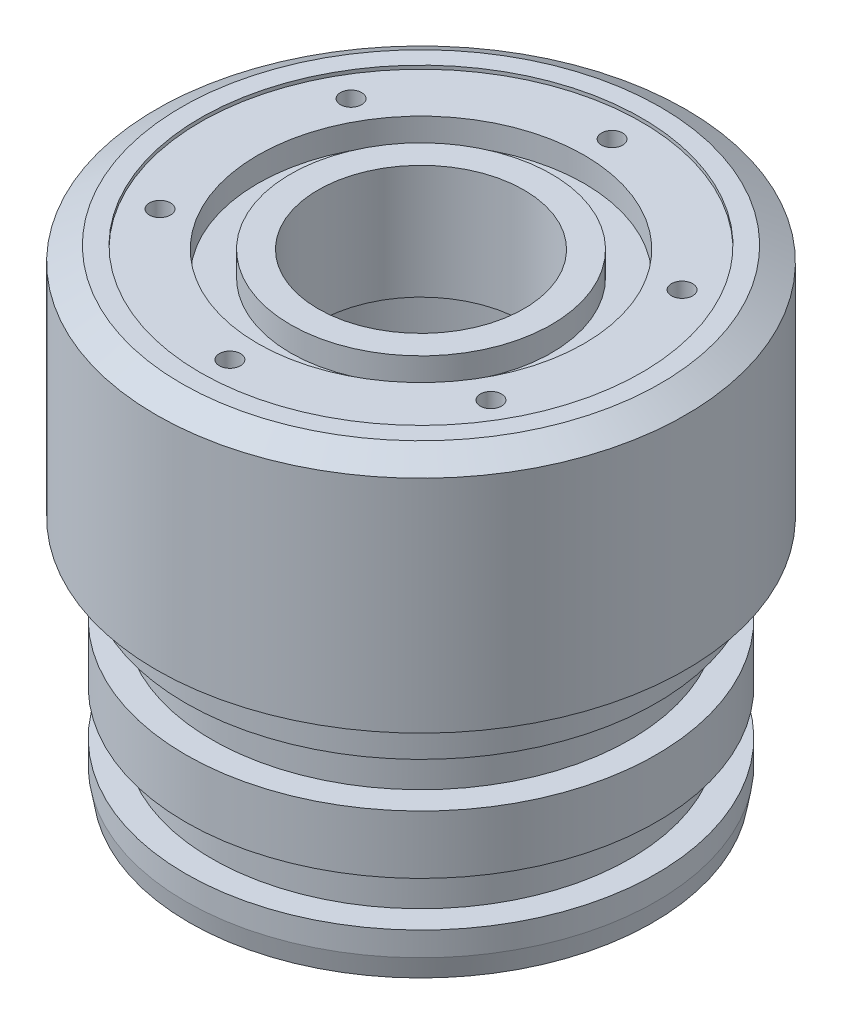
ISO-10303-21;
HEADER;
FILE_DESCRIPTION(('STEP AP214'),'2;1');
FILE_NAME('part.step','',(''),(''),'','','');
FILE_SCHEMA(('AUTOMOTIVE_DESIGN { 1 0 10303 214 1 1 1 1 }'));
ENDSEC;
DATA;
#1=APPLICATION_CONTEXT('core data for automotive mechanical design processes');
#2=APPLICATION_PROTOCOL_DEFINITION('international standard','automotive_design',2000,#1);
#3=PRODUCT_CONTEXT('',#1,'mechanical');
#4=PRODUCT('Part','Part','',(#3));
#5=PRODUCT_RELATED_PRODUCT_CATEGORY('part','',(#4));
#6=PRODUCT_DEFINITION_FORMATION('','',#4);
#7=PRODUCT_DEFINITION_CONTEXT('part definition',#1,'design');
#8=PRODUCT_DEFINITION('design','',#6,#7);
#9=PRODUCT_DEFINITION_SHAPE('','',#8);
#10=(LENGTH_UNIT() NAMED_UNIT(*) SI_UNIT(.MILLI.,.METRE.));
#11=(NAMED_UNIT(*) PLANE_ANGLE_UNIT() SI_UNIT($,.RADIAN.));
#12=(NAMED_UNIT(*) SI_UNIT($,.STERADIAN.) SOLID_ANGLE_UNIT());
#13=UNCERTAINTY_MEASURE_WITH_UNIT(LENGTH_MEASURE(1.E-05),#10,'distance_accuracy_value','');
#14=(GEOMETRIC_REPRESENTATION_CONTEXT(3) GLOBAL_UNCERTAINTY_ASSIGNED_CONTEXT((#13)) GLOBAL_UNIT_ASSIGNED_CONTEXT((#10,
#11,#12)) REPRESENTATION_CONTEXT('',''));
#15=CARTESIAN_POINT('',(0.,0.,0.));
#16=DIRECTION('',(0.,0.,1.));
#17=DIRECTION('',(1.,0.,0.));
#18=AXIS2_PLACEMENT_3D('',#15,#16,#17);
#19=CARTESIAN_POINT('',(0.,25.019,0.));
#20=DIRECTION('',(0.,1.,0.));
#21=DIRECTION('',(0.,0.,1.));
#22=AXIS2_PLACEMENT_3D('',#19,#20,#21);
#23=PLANE('',#22);
#24=CARTESIAN_POINT('',(0.,25.019,0.));
#25=DIRECTION('',(0.,1.,0.));
#26=DIRECTION('',(0.,0.,1.));
#27=AXIS2_PLACEMENT_3D('',#24,#25,#26);
#28=CIRCLE('',#27,11.1125);
#29=CARTESIAN_POINT('',(0.,25.019,11.1125));
#30=VERTEX_POINT('',#29);
#31=EDGE_CURVE('E36',#30,#30,#28,.F.);
#32=ORIENTED_EDGE('',*,*,#31,.T.);
#33=EDGE_LOOP('',(#32));
#34=FACE_BOUND('',#33,.T.);
#35=CARTESIAN_POINT('',(0.,25.019,0.));
#36=DIRECTION('',(0.,1.,0.));
#37=DIRECTION('',(0.,0.,1.));
#38=AXIS2_PLACEMENT_3D('',#35,#36,#37);
#39=CIRCLE('',#38,14.0843);
#40=CARTESIAN_POINT('',(0.,25.019,14.0843));
#41=VERTEX_POINT('',#40);
#42=EDGE_CURVE('E104',#41,#41,#39,.T.);
#43=ORIENTED_EDGE('',*,*,#42,.T.);
#44=EDGE_LOOP('',(#43));
#45=FACE_BOUND('',#44,.T.);
#46=ADVANCED_FACE('F32',(#34,#45),#23,.T.);
#47=CARTESIAN_POINT('',(0.,-25.4,0.));
#48=DIRECTION('',(0.,1.,0.));
#49=DIRECTION('',(0.,0.,1.));
#50=AXIS2_PLACEMENT_3D('',#47,#48,#49);
#51=CYLINDRICAL_SURFACE('',#50,11.1125);
#52=CARTESIAN_POINT('',(0.,12.7,0.));
#53=DIRECTION('',(0.,-1.,0.));
#54=DIRECTION('',(0.,0.,-1.));
#55=AXIS2_PLACEMENT_3D('',#52,#53,#54);
#56=CIRCLE('',#55,11.1125);
#57=CARTESIAN_POINT('',(0.,12.7,-11.1125));
#58=VERTEX_POINT('',#57);
#59=EDGE_CURVE('E86',#58,#58,#56,.T.);
#60=ORIENTED_EDGE('',*,*,#59,.T.);
#61=EDGE_LOOP('',(#60));
#62=FACE_BOUND('',#61,.T.);
#63=ORIENTED_EDGE('',*,*,#31,.F.);
#64=EDGE_LOOP('',(#63));
#65=FACE_BOUND('',#64,.T.);
#66=ADVANCED_FACE('F192',(#62,#65),#51,.F.);
#67=CARTESIAN_POINT('',(0.,-25.4,0.));
#68=DIRECTION('',(0.,1.,0.));
#69=DIRECTION('',(0.,0.,1.));
#70=AXIS2_PLACEMENT_3D('',#67,#68,#69);
#71=CYLINDRICAL_SURFACE('',#70,25.4);
#72=CARTESIAN_POINT('',(0.,-9.525,0.));
#73=DIRECTION('',(0.,-1.,0.));
#74=DIRECTION('',(0.,0.,-1.));
#75=AXIS2_PLACEMENT_3D('',#72,#73,#74);
#76=CIRCLE('',#75,25.4);
#77=CARTESIAN_POINT('',(0.,-9.525,-25.4));
#78=VERTEX_POINT('',#77);
#79=EDGE_CURVE('E57',#78,#78,#76,.F.);
#80=ORIENTED_EDGE('',*,*,#79,.F.);
#81=EDGE_LOOP('',(#80));
#82=FACE_BOUND('',#81,.T.);
#83=CARTESIAN_POINT('',(0.,-15.8242,0.));
#84=DIRECTION('',(0.,-1.,0.));
#85=DIRECTION('',(0.,0.,-1.));
#86=AXIS2_PLACEMENT_3D('',#83,#84,#85);
#87=CIRCLE('',#86,25.4);
#88=CARTESIAN_POINT('',(0.,-15.8242,-25.4));
#89=VERTEX_POINT('',#88);
#90=EDGE_CURVE('E61',#89,#89,#87,.F.);
#91=ORIENTED_EDGE('',*,*,#90,.T.);
#92=EDGE_LOOP('',(#91));
#93=FACE_BOUND('',#92,.T.);
#94=ADVANCED_FACE('F197',(#82,#93),#71,.T.);
#95=CARTESIAN_POINT('',(0.,-15.8242,0.));
#96=DIRECTION('',(0.,-1.,0.));
#97=DIRECTION('',(0.,0.,-1.));
#98=AXIS2_PLACEMENT_3D('',#95,#96,#97);
#99=PLANE('',#98);
#100=ORIENTED_EDGE('',*,*,#90,.F.);
#101=EDGE_LOOP('',(#100));
#102=FACE_BOUND('',#101,.T.);
#103=CARTESIAN_POINT('',(0.,-15.8242,0.));
#104=DIRECTION('',(0.,-1.,0.));
#105=DIRECTION('',(0.,0.,-1.));
#106=AXIS2_PLACEMENT_3D('',#103,#104,#105);
#107=CIRCLE('',#106,22.5806);
#108=CARTESIAN_POINT('',(0.,-15.8242,-22.5806));
#109=VERTEX_POINT('',#108);
#110=EDGE_CURVE('E68',#109,#109,#107,.T.);
#111=ORIENTED_EDGE('',*,*,#110,.F.);
#112=EDGE_LOOP('',(#111));
#113=FACE_BOUND('',#112,.T.);
#114=ADVANCED_FACE('F223',(#102,#113),#99,.T.);
#115=CARTESIAN_POINT('',(0.,-20.6502,0.));
#116=DIRECTION('',(0.,-1.,0.));
#117=DIRECTION('',(0.,0.,-1.));
#118=AXIS2_PLACEMENT_3D('',#115,#116,#117);
#119=PLANE('',#118);
#120=CARTESIAN_POINT('',(0.,-20.6502,0.));
#121=DIRECTION('',(0.,-1.,0.));
#122=DIRECTION('',(0.,0.,-1.));
#123=AXIS2_PLACEMENT_3D('',#120,#121,#122);
#124=CIRCLE('',#123,25.4);
#125=CARTESIAN_POINT('',(0.,-20.6502,-25.4));
#126=VERTEX_POINT('',#125);
#127=EDGE_CURVE('E65',#126,#126,#124,.F.);
#128=ORIENTED_EDGE('',*,*,#127,.T.);
#129=EDGE_LOOP('',(#128));
#130=FACE_BOUND('',#129,.T.);
#131=CARTESIAN_POINT('',(0.,-20.6502,0.));
#132=DIRECTION('',(0.,-1.,0.));
#133=DIRECTION('',(0.,0.,-1.));
#134=AXIS2_PLACEMENT_3D('',#131,#132,#133);
#135=CIRCLE('',#134,22.5806);
#136=CARTESIAN_POINT('',(0.,-20.6502,-22.5806));
#137=VERTEX_POINT('',#136);
#138=EDGE_CURVE('E56',#137,#137,#135,.T.);
#139=ORIENTED_EDGE('',*,*,#138,.T.);
#140=EDGE_LOOP('',(#139));
#141=FACE_BOUND('',#140,.T.);
#142=ADVANCED_FACE('F221',(#130,#141),#119,.F.);
#143=CARTESIAN_POINT('',(0.,-15.8242,0.));
#144=DIRECTION('',(0.,-1.,0.));
#145=DIRECTION('',(0.,0.,-1.));
#146=AXIS2_PLACEMENT_3D('',#143,#144,#145);
#147=CYLINDRICAL_SURFACE('',#146,22.5806);
#148=ORIENTED_EDGE('',*,*,#110,.T.);
#149=EDGE_LOOP('',(#148));
#150=FACE_BOUND('',#149,.T.);
#151=ORIENTED_EDGE('',*,*,#138,.F.);
#152=EDGE_LOOP('',(#151));
#153=FACE_BOUND('',#152,.T.);
#154=ADVANCED_FACE('F217',(#150,#153),#147,.T.);
#155=CARTESIAN_POINT('',(0.,12.7,0.));
#156=DIRECTION('',(0.,-1.,0.));
#157=DIRECTION('',(0.,0.,-1.));
#158=AXIS2_PLACEMENT_3D('',#155,#156,#157);
#159=PLANE('',#158);
#160=ORIENTED_EDGE('',*,*,#59,.F.);
#161=EDGE_LOOP('',(#160));
#162=FACE_BOUND('',#161,.T.);
#163=CARTESIAN_POINT('',(0.,12.7,0.));
#164=DIRECTION('',(0.,-1.,0.));
#165=DIRECTION('',(0.,0.,-1.));
#166=AXIS2_PLACEMENT_3D('',#163,#164,#165);
#167=CIRCLE('',#166,19.05);
#168=CARTESIAN_POINT('',(0.,12.7,-19.05));
#169=VERTEX_POINT('',#168);
#170=EDGE_CURVE('E74',#169,#169,#167,.T.);
#171=ORIENTED_EDGE('',*,*,#170,.T.);
#172=EDGE_LOOP('',(#171));
#173=FACE_BOUND('',#172,.T.);
#174=ADVANCED_FACE('F220',(#162,#173),#159,.T.);
#175=CARTESIAN_POINT('',(0.,12.7,0.));
#176=DIRECTION('',(0.,-1.,0.));
#177=DIRECTION('',(0.,0.,-1.));
#178=AXIS2_PLACEMENT_3D('',#175,#176,#177);
#179=CYLINDRICAL_SURFACE('',#178,19.05);
#180=CARTESIAN_POINT('',(0.,-25.4,0.));
#181=DIRECTION('',(0.,-1.,0.));
#182=DIRECTION('',(0.,0.,-1.));
#183=AXIS2_PLACEMENT_3D('',#180,#181,#182);
#184=CIRCLE('',#183,19.05);
#185=CARTESIAN_POINT('',(0.,-25.4,-19.05));
#186=VERTEX_POINT('',#185);
#187=EDGE_CURVE('E64',#186,#186,#184,.T.);
#188=CARTESIAN_POINT('',(0.,12.7,-19.05));
#189=CARTESIAN_POINT('',(0.,12.303125,-19.05));
#190=CARTESIAN_POINT('',(0.,11.90625,-19.05));
#191=CARTESIAN_POINT('',(0.,11.1125,-19.05));
#192=CARTESIAN_POINT('',(0.,10.715625,-19.05));
#193=CARTESIAN_POINT('',(0.,9.921875,-19.05));
#194=CARTESIAN_POINT('',(0.,9.525,-19.05));
#195=CARTESIAN_POINT('',(0.,8.73125,-19.05));
#196=CARTESIAN_POINT('',(0.,8.334375,-19.05));
#197=CARTESIAN_POINT('',(0.,7.540625,-19.05));
#198=CARTESIAN_POINT('',(0.,7.14375,-19.05));
#199=CARTESIAN_POINT('',(0.,6.35,-19.05));
#200=CARTESIAN_POINT('',(0.,5.953125,-19.05));
#201=CARTESIAN_POINT('',(0.,5.159375,-19.05));
#202=CARTESIAN_POINT('',(0.,4.7625,-19.05));
#203=CARTESIAN_POINT('',(0.,3.96875,-19.05));
#204=CARTESIAN_POINT('',(0.,3.571875,-19.05));
#205=CARTESIAN_POINT('',(0.,2.778125,-19.05));
#206=CARTESIAN_POINT('',(0.,2.38125,-19.05));
#207=CARTESIAN_POINT('',(0.,1.5875,-19.05));
#208=CARTESIAN_POINT('',(0.,1.190625,-19.05));
#209=CARTESIAN_POINT('',(0.,0.396875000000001,-19.05));
#210=CARTESIAN_POINT('',(0.,0.,-19.05));
#211=CARTESIAN_POINT('',(0.,-0.793749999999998,-19.05));
#212=CARTESIAN_POINT('',(0.,-1.190625,-19.05));
#213=CARTESIAN_POINT('',(0.,-1.984375,-19.05));
#214=CARTESIAN_POINT('',(0.,-2.38125,-19.05));
#215=CARTESIAN_POINT('',(0.,-3.175,-19.05));
#216=CARTESIAN_POINT('',(0.,-3.571875,-19.05));
#217=CARTESIAN_POINT('',(0.,-4.365625,-19.05));
#218=CARTESIAN_POINT('',(0.,-4.7625,-19.05));
#219=CARTESIAN_POINT('',(0.,-5.55625,-19.05));
#220=CARTESIAN_POINT('',(0.,-5.953125,-19.05));
#221=CARTESIAN_POINT('',(0.,-6.746875,-19.05));
#222=CARTESIAN_POINT('',(0.,-7.14375,-19.05));
#223=CARTESIAN_POINT('',(0.,-7.9375,-19.05));
#224=CARTESIAN_POINT('',(0.,-8.334375,-19.05));
#225=CARTESIAN_POINT('',(0.,-9.128125,-19.05));
#226=CARTESIAN_POINT('',(0.,-9.525,-19.05));
#227=CARTESIAN_POINT('',(0.,-10.31875,-19.05));
#228=CARTESIAN_POINT('',(0.,-10.715625,-19.05));
#229=CARTESIAN_POINT('',(0.,-11.509375,-19.05));
#230=CARTESIAN_POINT('',(0.,-11.90625,-19.05));
#231=CARTESIAN_POINT('',(0.,-12.7,-19.05));
#232=CARTESIAN_POINT('',(0.,-13.096875,-19.05));
#233=CARTESIAN_POINT('',(0.,-13.890625,-19.05));
#234=CARTESIAN_POINT('',(0.,-14.2875,-19.05));
#235=CARTESIAN_POINT('',(0.,-15.08125,-19.05));
#236=CARTESIAN_POINT('',(0.,-15.478125,-19.05));
#237=CARTESIAN_POINT('',(0.,-16.271875,-19.05));
#238=CARTESIAN_POINT('',(0.,-16.66875,-19.05));
#239=CARTESIAN_POINT('',(0.,-17.4625,-19.05));
#240=CARTESIAN_POINT('',(0.,-17.859375,-19.05));
#241=CARTESIAN_POINT('',(0.,-18.653125,-19.05));
#242=CARTESIAN_POINT('',(0.,-19.05,-19.05));
#243=CARTESIAN_POINT('',(0.,-19.84375,-19.05));
#244=CARTESIAN_POINT('',(0.,-20.240625,-19.05));
#245=CARTESIAN_POINT('',(0.,-21.034375,-19.05));
#246=CARTESIAN_POINT('',(0.,-21.43125,-19.05));
#247=CARTESIAN_POINT('',(0.,-22.225,-19.05));
#248=CARTESIAN_POINT('',(0.,-22.621875,-19.05));
#249=CARTESIAN_POINT('',(0.,-23.415625,-19.05));
#250=CARTESIAN_POINT('',(0.,-23.8125,-19.05));
#251=CARTESIAN_POINT('',(0.,-24.60625,-19.05));
#252=CARTESIAN_POINT('',(0.,-25.003125,-19.05));
#253=CARTESIAN_POINT('',(0.,-25.4,-19.05));
#254=B_SPLINE_CURVE_WITH_KNOTS('',3,(#188,#189,#190,#191,#192,#193,#194,#195,#196,#197,#198,
#199,#200,#201,#202,#203,#204,#205,#206,#207,#208,#209,#210,#211,#212,#213,#214,#215,#216,#217,
#218,#219,#220,#221,#222,#223,#224,#225,#226,#227,#228,#229,#230,#231,#232,#233,#234,#235,#236,
#237,#238,#239,#240,#241,#242,#243,#244,#245,#246,#247,#248,#249,#250,#251,#252,#253),
.UNSPECIFIED.,.F.,.F.,(4,2,2,2,2,2,2,2,2,2,2,2,2,2,2,2,2,2,2,2,2,2,2,2,2,2,2,2,2,2,2,2,4),(0.,
1.190625,2.38125,3.571875,4.7625,5.953125,7.14375,8.334375,9.525,10.715625,11.90625,13.096875,
14.2875,15.478125,16.66875,17.859375,19.05,20.240625,21.43125,22.621875,23.8125,25.003125,
26.19375,27.384375,28.575,29.765625,30.95625,32.146875,33.3375,34.528125,35.71875,36.909375,
38.1),.UNSPECIFIED.);
#255=EDGE_CURVE('BSEAM232',#169,#186,#254,.T.);
#256=ORIENTED_EDGE('',*,*,#170,.F.);
#257=ORIENTED_EDGE('',*,*,#187,.T.);
#258=ORIENTED_EDGE('',*,*,#255,.T.);
#259=ORIENTED_EDGE('',*,*,#255,.F.);
#260=EDGE_LOOP('',(#256,#258,#257,#259));
#261=FACE_BOUND('',#260,.T.);
#262=ADVANCED_FACE('F232',(#261),#179,.F.);
#263=CARTESIAN_POINT('',(0.,-25.4,0.));
#264=DIRECTION('',(0.,1.,0.));
#265=DIRECTION('',(0.,0.,1.));
#266=AXIS2_PLACEMENT_3D('',#263,#264,#265);
#267=PLANE('',#266);
#268=CARTESIAN_POINT('',(0.,-25.4,0.));
#269=DIRECTION('',(0.,1.,0.));
#270=DIRECTION('',(0.,0.,1.));
#271=AXIS2_PLACEMENT_3D('',#268,#269,#270);
#272=CIRCLE('',#271,25.019);
#273=CARTESIAN_POINT('',(0.,-25.4,25.019));
#274=VERTEX_POINT('',#273);
#275=EDGE_CURVE('E44',#274,#274,#272,.F.);
#276=ORIENTED_EDGE('',*,*,#275,.T.);
#277=EDGE_LOOP('',(#276));
#278=FACE_BOUND('',#277,.T.);
#279=ORIENTED_EDGE('',*,*,#187,.F.);
#280=EDGE_LOOP('',(#279));
#281=FACE_BOUND('',#280,.T.);
#282=ADVANCED_FACE('F235',(#278,#281),#267,.F.);
#283=CARTESIAN_POINT('',(0.,-23.2392416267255,0.));
#284=DIRECTION('',(0.,1.,0.));
#285=DIRECTION('',(0.,0.,1.));
#286=AXIS2_PLACEMENT_3D('',#283,#284,#285);
#287=CIRCLE('',#286,25.4);
#288=CARTESIAN_POINT('',(0.,-23.2392416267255,25.4));
#289=VERTEX_POINT('',#288);
#290=EDGE_CURVE('E49',#289,#289,#287,.T.);
#291=ORIENTED_EDGE('',*,*,#290,.T.);
#292=EDGE_LOOP('',(#291));
#293=FACE_BOUND('',#292,.T.);
#294=ORIENTED_EDGE('',*,*,#127,.F.);
#295=EDGE_LOOP('',(#294));
#296=FACE_BOUND('',#295,.T.);
#297=ADVANCED_FACE('F212',(#293,#296),#71,.T.);
#298=CARTESIAN_POINT('',(0.,-4.699,0.));
#299=DIRECTION('',(0.,-1.,0.));
#300=DIRECTION('',(0.,0.,-1.));
#301=AXIS2_PLACEMENT_3D('',#298,#299,#300);
#302=PLANE('',#301);
#303=CARTESIAN_POINT('',(0.,-4.699,0.));
#304=DIRECTION('',(0.,-1.,0.));
#305=DIRECTION('',(0.,0.,-1.));
#306=AXIS2_PLACEMENT_3D('',#303,#304,#305);
#307=CIRCLE('',#306,25.4);
#308=CARTESIAN_POINT('',(0.,-4.699,-25.4));
#309=VERTEX_POINT('',#308);
#310=EDGE_CURVE('E53',#309,#309,#307,.F.);
#311=ORIENTED_EDGE('',*,*,#310,.F.);
#312=EDGE_LOOP('',(#311));
#313=FACE_BOUND('',#312,.T.);
#314=CARTESIAN_POINT('',(0.,-4.699,0.));
#315=DIRECTION('',(0.,-1.,0.));
#316=DIRECTION('',(0.,0.,-1.));
#317=AXIS2_PLACEMENT_3D('',#314,#315,#316);
#318=CIRCLE('',#317,22.5806);
#319=CARTESIAN_POINT('',(0.,-4.699,-22.5806));
#320=VERTEX_POINT('',#319);
#321=EDGE_CURVE('E60',#320,#320,#318,.T.);
#322=ORIENTED_EDGE('',*,*,#321,.F.);
#323=EDGE_LOOP('',(#322));
#324=FACE_BOUND('',#323,.T.);
#325=ADVANCED_FACE('F209',(#313,#324),#302,.T.);
#326=CARTESIAN_POINT('',(0.,-9.525,0.));
#327=DIRECTION('',(0.,-1.,0.));
#328=DIRECTION('',(0.,0.,-1.));
#329=AXIS2_PLACEMENT_3D('',#326,#327,#328);
#330=PLANE('',#329);
#331=ORIENTED_EDGE('',*,*,#79,.T.);
#332=EDGE_LOOP('',(#331));
#333=FACE_BOUND('',#332,.T.);
#334=CARTESIAN_POINT('',(0.,-9.525,0.));
#335=DIRECTION('',(0.,-1.,0.));
#336=DIRECTION('',(0.,0.,-1.));
#337=AXIS2_PLACEMENT_3D('',#334,#335,#336);
#338=CIRCLE('',#337,22.5806);
#339=CARTESIAN_POINT('',(0.,-9.525,-22.5806));
#340=VERTEX_POINT('',#339);
#341=EDGE_CURVE('E83',#340,#340,#338,.T.);
#342=ORIENTED_EDGE('',*,*,#341,.T.);
#343=EDGE_LOOP('',(#342));
#344=FACE_BOUND('',#343,.T.);
#345=ADVANCED_FACE('F207',(#333,#344),#330,.F.);
#346=CARTESIAN_POINT('',(0.,-4.699,0.));
#347=DIRECTION('',(0.,-1.,0.));
#348=DIRECTION('',(0.,0.,-1.));
#349=AXIS2_PLACEMENT_3D('',#346,#347,#348);
#350=CYLINDRICAL_SURFACE('',#349,22.5806);
#351=ORIENTED_EDGE('',*,*,#321,.T.);
#352=EDGE_LOOP('',(#351));
#353=FACE_BOUND('',#352,.T.);
#354=ORIENTED_EDGE('',*,*,#341,.F.);
#355=EDGE_LOOP('',(#354));
#356=FACE_BOUND('',#355,.T.);
#357=ADVANCED_FACE('F179',(#353,#356),#350,.T.);
#358=CARTESIAN_POINT('',(0.,25.4,0.));
#359=DIRECTION('',(0.,1.,0.));
#360=DIRECTION('',(0.,0.,1.));
#361=AXIS2_PLACEMENT_3D('',#358,#359,#360);
#362=PLANE('',#361);
#363=CARTESIAN_POINT('',(0.,25.4,0.));
#364=DIRECTION('',(0.,1.,0.));
#365=DIRECTION('',(0.,0.,1.));
#366=AXIS2_PLACEMENT_3D('',#363,#364,#365);
#367=CIRCLE('',#366,23.8125);
#368=CARTESIAN_POINT('',(0.,25.4,23.8125));
#369=VERTEX_POINT('',#368);
#370=EDGE_CURVE('E91',#369,#369,#367,.T.);
#371=ORIENTED_EDGE('',*,*,#370,.F.);
#372=EDGE_LOOP('',(#371));
#373=FACE_BOUND('',#372,.T.);
#374=CARTESIAN_POINT('',(0.,25.4,0.));
#375=DIRECTION('',(0.,1.,0.));
#376=DIRECTION('',(0.,0.,1.));
#377=AXIS2_PLACEMENT_3D('',#374,#375,#376);
#378=CIRCLE('',#377,25.8473663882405);
#379=CARTESIAN_POINT('',(0.,25.4,25.8473663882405));
#380=VERTEX_POINT('',#379);
#381=EDGE_CURVE('E40',#380,#380,#378,.T.);
#382=ORIENTED_EDGE('',*,*,#381,.T.);
#383=EDGE_LOOP('',(#382));
#384=FACE_BOUND('',#383,.T.);
#385=ADVANCED_FACE('F175',(#373,#384),#362,.T.);
#386=CARTESIAN_POINT('',(0.,25.4,0.));
#387=DIRECTION('',(0.,-1.,0.));
#388=DIRECTION('',(0.,0.,-1.));
#389=AXIS2_PLACEMENT_3D('',#386,#387,#388);
#390=CYLINDRICAL_SURFACE('',#389,28.575);
#391=CARTESIAN_POINT('',(0.,23.8252,0.));
#392=DIRECTION('',(0.,1.,0.));
#393=DIRECTION('',(0.,0.,1.));
#394=AXIS2_PLACEMENT_3D('',#391,#392,#393);
#395=CIRCLE('',#394,28.575);
#396=CARTESIAN_POINT('',(0.,23.8252,28.575));
#397=VERTEX_POINT('',#396);
#398=EDGE_CURVE('E11',#397,#397,#395,.F.);
#399=ORIENTED_EDGE('',*,*,#398,.T.);
#400=EDGE_LOOP('',(#399));
#401=FACE_BOUND('',#400,.T.);
#402=CARTESIAN_POINT('',(0.,0.,0.));
#403=DIRECTION('',(0.,1.,0.));
#404=DIRECTION('',(0.,0.,1.));
#405=AXIS2_PLACEMENT_3D('',#402,#403,#404);
#406=CIRCLE('',#405,28.575);
#407=CARTESIAN_POINT('',(0.,0.,28.575));
#408=VERTEX_POINT('',#407);
#409=EDGE_CURVE('E71',#408,#408,#406,.T.);
#410=ORIENTED_EDGE('',*,*,#409,.T.);
#411=EDGE_LOOP('',(#410));
#412=FACE_BOUND('',#411,.T.);
#413=ADVANCED_FACE('F178',(#401,#412),#390,.T.);
#414=CARTESIAN_POINT('',(0.,0.,0.));
#415=DIRECTION('',(0.,1.,0.));
#416=DIRECTION('',(0.,0.,1.));
#417=AXIS2_PLACEMENT_3D('',#414,#415,#416);
#418=PLANE('',#417);
#419=CARTESIAN_POINT('',(0.,0.,0.));
#420=DIRECTION('',(0.,1.,0.));
#421=DIRECTION('',(0.,0.,1.));
#422=AXIS2_PLACEMENT_3D('',#419,#420,#421);
#423=CIRCLE('',#422,25.4);
#424=CARTESIAN_POINT('',(0.,0.,25.4));
#425=VERTEX_POINT('',#424);
#426=EDGE_CURVE('E52',#425,#425,#423,.T.);
#427=ORIENTED_EDGE('',*,*,#426,.T.);
#428=EDGE_LOOP('',(#427));
#429=FACE_BOUND('',#428,.T.);
#430=ORIENTED_EDGE('',*,*,#409,.F.);
#431=EDGE_LOOP('',(#430));
#432=FACE_BOUND('',#431,.T.);
#433=ADVANCED_FACE('F238',(#429,#432),#418,.F.);
#434=ORIENTED_EDGE('',*,*,#426,.F.);
#435=EDGE_LOOP('',(#434));
#436=FACE_BOUND('',#435,.T.);
#437=ORIENTED_EDGE('',*,*,#310,.T.);
#438=EDGE_LOOP('',(#437));
#439=FACE_BOUND('',#438,.T.);
#440=ADVANCED_FACE('F189',(#436,#439),#71,.T.);
#441=CARTESIAN_POINT('',(0.,-23.2392416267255,0.));
#442=DIRECTION('',(0.,1.,0.));
#443=DIRECTION('',(0.,0.,1.));
#444=AXIS2_PLACEMENT_3D('',#441,#442,#443);
#445=CONICAL_SURFACE('',#444,25.4,0.174532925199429);
#446=CARTESIAN_POINT('',(0.,-25.4,25.019));
#447=CARTESIAN_POINT('',(0.,-25.3774921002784,25.02296875));
#448=CARTESIAN_POINT('',(0.,-25.3549842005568,25.0269375));
#449=CARTESIAN_POINT('',(0.,-25.3099684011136,25.034875));
#450=CARTESIAN_POINT('',(0.,-25.287460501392,25.03884375));
#451=CARTESIAN_POINT('',(0.,-25.2424447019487,25.04678125));
#452=CARTESIAN_POINT('',(0.,-25.2199368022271,25.05075));
#453=CARTESIAN_POINT('',(0.,-25.1749210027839,25.0586875));
#454=CARTESIAN_POINT('',(0.,-25.1524131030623,25.06265625));
#455=CARTESIAN_POINT('',(0.,-25.1073973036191,25.07059375));
#456=CARTESIAN_POINT('',(0.,-25.0848894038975,25.0745625));
#457=CARTESIAN_POINT('',(0.,-25.0398736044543,25.0825));
#458=CARTESIAN_POINT('',(0.,-25.0173657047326,25.08646875));
#459=CARTESIAN_POINT('',(0.,-24.9723499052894,25.09440625));
#460=CARTESIAN_POINT('',(0.,-24.9498420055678,25.098375));
#461=CARTESIAN_POINT('',(0.,-24.9048262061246,25.1063125));
#462=CARTESIAN_POINT('',(0.,-24.882318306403,25.11028125));
#463=CARTESIAN_POINT('',(0.,-24.8373025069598,25.11821875));
#464=CARTESIAN_POINT('',(0.,-24.8147946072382,25.1221875));
#465=CARTESIAN_POINT('',(0.,-24.7697788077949,25.130125));
#466=CARTESIAN_POINT('',(0.,-24.7472709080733,25.13409375));
#467=CARTESIAN_POINT('',(0.,-24.7022551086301,25.14203125));
#468=CARTESIAN_POINT('',(0.,-24.6797472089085,25.146));
#469=CARTESIAN_POINT('',(0.,-24.6347314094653,25.1539375));
#470=CARTESIAN_POINT('',(0.,-24.6122235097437,25.15790625));
#471=CARTESIAN_POINT('',(0.,-24.5672077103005,25.16584375));
#472=CARTESIAN_POINT('',(0.,-24.5446998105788,25.1698125));
#473=CARTESIAN_POINT('',(0.,-24.4996840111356,25.17775));
#474=CARTESIAN_POINT('',(0.,-24.477176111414,25.18171875));
#475=CARTESIAN_POINT('',(0.,-24.4321603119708,25.18965625));
#476=CARTESIAN_POINT('',(0.,-24.4096524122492,25.193625));
#477=CARTESIAN_POINT('',(0.,-24.364636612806,25.2015625));
#478=CARTESIAN_POINT('',(0.,-24.3421287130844,25.20553125));
#479=CARTESIAN_POINT('',(0.,-24.2971129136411,25.21346875));
#480=CARTESIAN_POINT('',(0.,-24.2746050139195,25.2174375));
#481=CARTESIAN_POINT('',(0.,-24.2295892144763,25.225375));
#482=CARTESIAN_POINT('',(0.,-24.2070813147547,25.22934375));
#483=CARTESIAN_POINT('',(0.,-24.1620655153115,25.23728125));
#484=CARTESIAN_POINT('',(0.,-24.1395576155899,25.24125));
#485=CARTESIAN_POINT('',(0.,-24.0945418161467,25.2491875));
#486=CARTESIAN_POINT('',(0.,-24.072033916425,25.25315625));
#487=CARTESIAN_POINT('',(0.,-24.0270181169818,25.26109375));
#488=CARTESIAN_POINT('',(0.,-24.0045102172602,25.2650625));
#489=CARTESIAN_POINT('',(0.,-23.959494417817,25.273));
#490=CARTESIAN_POINT('',(0.,-23.9369865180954,25.27696875));
#491=CARTESIAN_POINT('',(0.,-23.8919707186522,25.28490625));
#492=CARTESIAN_POINT('',(0.,-23.8694628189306,25.288875));
#493=CARTESIAN_POINT('',(0.,-23.8244470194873,25.2968125));
#494=CARTESIAN_POINT('',(0.,-23.8019391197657,25.30078125));
#495=CARTESIAN_POINT('',(0.,-23.7569233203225,25.30871875));
#496=CARTESIAN_POINT('',(0.,-23.7344154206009,25.3126875));
#497=CARTESIAN_POINT('',(0.,-23.6893996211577,25.320625));
#498=CARTESIAN_POINT('',(0.,-23.6668917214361,25.32459375));
#499=CARTESIAN_POINT('',(0.,-23.6218759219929,25.33253125));
#500=CARTESIAN_POINT('',(0.,-23.5993680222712,25.3365));
#501=CARTESIAN_POINT('',(0.,-23.554352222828,25.3444375));
#502=CARTESIAN_POINT('',(0.,-23.5318443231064,25.34840625));
#503=CARTESIAN_POINT('',(0.,-23.4868285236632,25.35634375));
#504=CARTESIAN_POINT('',(0.,-23.4643206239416,25.3603125));
#505=CARTESIAN_POINT('',(0.,-23.4193048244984,25.36825));
#506=CARTESIAN_POINT('',(0.,-23.3967969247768,25.37221875));
#507=CARTESIAN_POINT('',(0.,-23.3517811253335,25.38015625));
#508=CARTESIAN_POINT('',(0.,-23.3292732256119,25.384125));
#509=CARTESIAN_POINT('',(0.,-23.2842574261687,25.3920625));
#510=CARTESIAN_POINT('',(0.,-23.2617495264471,25.39603125));
#511=CARTESIAN_POINT('',(0.,-23.2392416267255,25.4));
#512=B_SPLINE_CURVE_WITH_KNOTS('',3,(#446,#447,#448,#449,#450,#451,#452,#453,#454,#455,#456,
#457,#458,#459,#460,#461,#462,#463,#464,#465,#466,#467,#468,#469,#470,#471,#472,#473,#474,#475,
#476,#477,#478,#479,#480,#481,#482,#483,#484,#485,#486,#487,#488,#489,#490,#491,#492,#493,#494,
#495,#496,#497,#498,#499,#500,#501,#502,#503,#504,#505,#506,#507,#508,#509,#510,#511),
.UNSPECIFIED.,.F.,.F.,(4,2,2,2,2,2,2,2,2,2,2,2,2,2,2,2,2,2,2,2,2,2,2,2,2,2,2,2,2,2,2,2,4),(0.,
0.0685653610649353,0.137130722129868,0.205696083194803,0.274261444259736,0.342826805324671,
0.411392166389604,0.479957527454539,0.548522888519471,0.617088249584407,0.685653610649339,
0.754218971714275,0.822784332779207,0.891349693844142,0.959915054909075,1.02848041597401,
1.09704577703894,1.16561113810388,1.23417649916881,1.30274186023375,1.37130722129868,
1.43987258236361,1.50843794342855,1.57700330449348,1.64556866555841,1.71413402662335,
1.78269938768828,1.85126474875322,1.91983010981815,1.98839547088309,2.05696083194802,
2.12552619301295,2.19409155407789),.UNSPECIFIED.);
#513=EDGE_CURVE('BSEAM184',#274,#289,#512,.T.);
#514=ORIENTED_EDGE('',*,*,#275,.F.);
#515=ORIENTED_EDGE('',*,*,#290,.F.);
#516=ORIENTED_EDGE('',*,*,#513,.T.);
#517=ORIENTED_EDGE('',*,*,#513,.F.);
#518=EDGE_LOOP('',(#514,#516,#515,#517));
#519=FACE_BOUND('',#518,.T.);
#520=ADVANCED_FACE('F184',(#519),#445,.T.);
#521=CARTESIAN_POINT('',(0.,25.4,0.));
#522=DIRECTION('',(0.,-1.,0.));
#523=DIRECTION('',(0.,0.,-1.));
#524=AXIS2_PLACEMENT_3D('',#521,#522,#523);
#525=CONICAL_SURFACE('',#524,25.8473663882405,1.04719755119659);
#526=ORIENTED_EDGE('',*,*,#398,.F.);
#527=EDGE_LOOP('',(#526));
#528=FACE_BOUND('',#527,.T.);
#529=ORIENTED_EDGE('',*,*,#381,.F.);
#530=EDGE_LOOP('',(#529));
#531=FACE_BOUND('',#530,.T.);
#532=ADVANCED_FACE('F34',(#528,#531),#525,.T.);
#533=CARTESIAN_POINT('',(17.8616007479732,25.019,-10.3124000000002));
#534=DIRECTION('',(0.,1.,0.));
#535=DIRECTION('',(-0.866025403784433,0.,0.50000000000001));
#536=AXIS2_PLACEMENT_3D('',#533,#534,#535);
#537=CIRCLE('',#536,1.143);
#538=CARTESIAN_POINT('',(16.8717337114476,25.019,-9.7409000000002));
#539=VERTEX_POINT('',#538);
#540=EDGE_CURVE('E122',#539,#539,#537,.T.);
#541=ORIENTED_EDGE('',*,*,#540,.F.);
#542=EDGE_LOOP('',(#541));
#543=FACE_BOUND('',#542,.T.);
#544=CARTESIAN_POINT('',(17.8616007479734,25.019,10.3123999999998));
#545=DIRECTION('',(0.,1.,0.));
#546=DIRECTION('',(-0.866025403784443,0.,-0.499999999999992));
#547=AXIS2_PLACEMENT_3D('',#544,#545,#546);
#548=CIRCLE('',#547,1.143);
#549=CARTESIAN_POINT('',(16.8717337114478,25.019,9.74089999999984));
#550=VERTEX_POINT('',#549);
#551=EDGE_CURVE('E128',#550,#550,#548,.T.);
#552=ORIENTED_EDGE('',*,*,#551,.F.);
#553=EDGE_LOOP('',(#552));
#554=FACE_BOUND('',#553,.T.);
#555=CARTESIAN_POINT('',(0.,25.019,20.6248));
#556=DIRECTION('',(0.,1.,0.));
#557=DIRECTION('',(0.,0.,-1.));
#558=AXIS2_PLACEMENT_3D('',#555,#556,#557);
#559=CIRCLE('',#558,1.143);
#560=CARTESIAN_POINT('',(0.,25.019,19.4818));
#561=VERTEX_POINT('',#560);
#562=EDGE_CURVE('E134',#561,#561,#559,.T.);
#563=ORIENTED_EDGE('',*,*,#562,.F.);
#564=EDGE_LOOP('',(#563));
#565=FACE_BOUND('',#564,.T.);
#566=CARTESIAN_POINT('',(-17.8616007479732,25.019,10.3124000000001));
#567=DIRECTION('',(0.,1.,0.));
#568=DIRECTION('',(0.866025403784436,0.,-0.500000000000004));
#569=AXIS2_PLACEMENT_3D('',#566,#567,#568);
#570=CIRCLE('',#569,1.143);
#571=CARTESIAN_POINT('',(-16.8717337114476,25.019,9.74090000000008));
#572=VERTEX_POINT('',#571);
#573=EDGE_CURVE('E140',#572,#572,#570,.T.);
#574=ORIENTED_EDGE('',*,*,#573,.F.);
#575=EDGE_LOOP('',(#574));
#576=FACE_BOUND('',#575,.T.);
#577=CARTESIAN_POINT('',(-17.8616007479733,25.019,-10.3124));
#578=DIRECTION('',(0.,1.,0.));
#579=DIRECTION('',(0.86602540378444,0.,0.499999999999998));
#580=AXIS2_PLACEMENT_3D('',#577,#578,#579);
#581=CIRCLE('',#580,1.143);
#582=CARTESIAN_POINT('',(-16.8717337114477,25.019,-9.74089999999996));
#583=VERTEX_POINT('',#582);
#584=EDGE_CURVE('E116',#583,#583,#581,.T.);
#585=ORIENTED_EDGE('',*,*,#584,.F.);
#586=EDGE_LOOP('',(#585));
#587=FACE_BOUND('',#586,.T.);
#588=CARTESIAN_POINT('',(0.,25.019,-20.6248));
#589=DIRECTION('',(0.,1.,0.));
#590=DIRECTION('',(0.,0.,1.));
#591=AXIS2_PLACEMENT_3D('',#588,#589,#590);
#592=CIRCLE('',#591,1.143);
#593=CARTESIAN_POINT('',(0.,25.019,-19.4818));
#594=VERTEX_POINT('',#593);
#595=EDGE_CURVE('E110',#594,#594,#592,.T.);
#596=ORIENTED_EDGE('',*,*,#595,.F.);
#597=EDGE_LOOP('',(#596));
#598=FACE_BOUND('',#597,.T.);
#599=CARTESIAN_POINT('',(0.,25.019,0.));
#600=DIRECTION('',(0.,1.,0.));
#601=DIRECTION('',(0.,0.,1.));
#602=AXIS2_PLACEMENT_3D('',#599,#600,#601);
#603=CIRCLE('',#602,17.6149);
#604=CARTESIAN_POINT('',(0.,25.019,17.6149));
#605=VERTEX_POINT('',#604);
#606=EDGE_CURVE('E98',#605,#605,#603,.T.);
#607=ORIENTED_EDGE('',*,*,#606,.F.);
#608=EDGE_LOOP('',(#607));
#609=FACE_BOUND('',#608,.T.);
#610=CARTESIAN_POINT('',(0.,25.019,0.));
#611=DIRECTION('',(0.,1.,0.));
#612=DIRECTION('',(0.,0.,1.));
#613=AXIS2_PLACEMENT_3D('',#610,#611,#612);
#614=CIRCLE('',#613,23.8125);
#615=CARTESIAN_POINT('',(0.,25.019,23.8125));
#616=VERTEX_POINT('',#615);
#617=EDGE_CURVE('E94',#616,#616,#614,.T.);
#618=ORIENTED_EDGE('',*,*,#617,.T.);
#619=EDGE_LOOP('',(#618));
#620=FACE_BOUND('',#619,.T.);
#621=ADVANCED_FACE('F155',(#543,#554,#565,#576,#587,#598,#609,#620),#23,.T.);
#622=CARTESIAN_POINT('',(0.,25.019,0.));
#623=DIRECTION('',(0.,1.,0.));
#624=DIRECTION('',(0.,0.,1.));
#625=AXIS2_PLACEMENT_3D('',#622,#623,#624);
#626=CYLINDRICAL_SURFACE('',#625,23.8125);
#627=CARTESIAN_POINT('',(0.,25.019,23.8125));
#628=CARTESIAN_POINT('',(0.,25.02296875,23.8125));
#629=CARTESIAN_POINT('',(0.,25.0269375,23.8125));
#630=CARTESIAN_POINT('',(0.,25.034875,23.8125));
#631=CARTESIAN_POINT('',(0.,25.03884375,23.8125));
#632=CARTESIAN_POINT('',(0.,25.04678125,23.8125));
#633=CARTESIAN_POINT('',(0.,25.05075,23.8125));
#634=CARTESIAN_POINT('',(0.,25.0586875,23.8125));
#635=CARTESIAN_POINT('',(0.,25.06265625,23.8125));
#636=CARTESIAN_POINT('',(0.,25.07059375,23.8125));
#637=CARTESIAN_POINT('',(0.,25.0745625,23.8125));
#638=CARTESIAN_POINT('',(0.,25.0825,23.8125));
#639=CARTESIAN_POINT('',(0.,25.08646875,23.8125));
#640=CARTESIAN_POINT('',(0.,25.09440625,23.8125));
#641=CARTESIAN_POINT('',(0.,25.098375,23.8125));
#642=CARTESIAN_POINT('',(0.,25.1063125,23.8125));
#643=CARTESIAN_POINT('',(0.,25.11028125,23.8125));
#644=CARTESIAN_POINT('',(0.,25.11821875,23.8125));
#645=CARTESIAN_POINT('',(0.,25.1221875,23.8125));
#646=CARTESIAN_POINT('',(0.,25.130125,23.8125));
#647=CARTESIAN_POINT('',(0.,25.13409375,23.8125));
#648=CARTESIAN_POINT('',(0.,25.14203125,23.8125));
#649=CARTESIAN_POINT('',(0.,25.146,23.8125));
#650=CARTESIAN_POINT('',(0.,25.1539375,23.8125));
#651=CARTESIAN_POINT('',(0.,25.15790625,23.8125));
#652=CARTESIAN_POINT('',(0.,25.16584375,23.8125));
#653=CARTESIAN_POINT('',(0.,25.1698125,23.8125));
#654=CARTESIAN_POINT('',(0.,25.17775,23.8125));
#655=CARTESIAN_POINT('',(0.,25.18171875,23.8125));
#656=CARTESIAN_POINT('',(0.,25.18965625,23.8125));
#657=CARTESIAN_POINT('',(0.,25.193625,23.8125));
#658=CARTESIAN_POINT('',(0.,25.2015625,23.8125));
#659=CARTESIAN_POINT('',(0.,25.20553125,23.8125));
#660=CARTESIAN_POINT('',(0.,25.21346875,23.8125));
#661=CARTESIAN_POINT('',(0.,25.2174375,23.8125));
#662=CARTESIAN_POINT('',(0.,25.225375,23.8125));
#663=CARTESIAN_POINT('',(0.,25.22934375,23.8125));
#664=CARTESIAN_POINT('',(0.,25.23728125,23.8125));
#665=CARTESIAN_POINT('',(0.,25.24125,23.8125));
#666=CARTESIAN_POINT('',(0.,25.2491875,23.8125));
#667=CARTESIAN_POINT('',(0.,25.25315625,23.8125));
#668=CARTESIAN_POINT('',(0.,25.26109375,23.8125));
#669=CARTESIAN_POINT('',(0.,25.2650625,23.8125));
#670=CARTESIAN_POINT('',(0.,25.273,23.8125));
#671=CARTESIAN_POINT('',(0.,25.27696875,23.8125));
#672=CARTESIAN_POINT('',(0.,25.28490625,23.8125));
#673=CARTESIAN_POINT('',(0.,25.288875,23.8125));
#674=CARTESIAN_POINT('',(0.,25.2968125,23.8125));
#675=CARTESIAN_POINT('',(0.,25.30078125,23.8125));
#676=CARTESIAN_POINT('',(0.,25.30871875,23.8125));
#677=CARTESIAN_POINT('',(0.,25.3126875,23.8125));
#678=CARTESIAN_POINT('',(0.,25.320625,23.8125));
#679=CARTESIAN_POINT('',(0.,25.32459375,23.8125));
#680=CARTESIAN_POINT('',(0.,25.33253125,23.8125));
#681=CARTESIAN_POINT('',(0.,25.3365,23.8125));
#682=CARTESIAN_POINT('',(0.,25.3444375,23.8125));
#683=CARTESIAN_POINT('',(0.,25.34840625,23.8125));
#684=CARTESIAN_POINT('',(0.,25.35634375,23.8125));
#685=CARTESIAN_POINT('',(0.,25.3603125,23.8125));
#686=CARTESIAN_POINT('',(0.,25.36825,23.8125));
#687=CARTESIAN_POINT('',(0.,25.37221875,23.8125));
#688=CARTESIAN_POINT('',(0.,25.38015625,23.8125));
#689=CARTESIAN_POINT('',(0.,25.384125,23.8125));
#690=CARTESIAN_POINT('',(0.,25.3920625,23.8125));
#691=CARTESIAN_POINT('',(0.,25.39603125,23.8125));
#692=CARTESIAN_POINT('',(0.,25.4,23.8125));
#693=B_SPLINE_CURVE_WITH_KNOTS('',3,(#627,#628,#629,#630,#631,#632,#633,#634,#635,#636,#637,
#638,#639,#640,#641,#642,#643,#644,#645,#646,#647,#648,#649,#650,#651,#652,#653,#654,#655,#656,
#657,#658,#659,#660,#661,#662,#663,#664,#665,#666,#667,#668,#669,#670,#671,#672,#673,#674,#675,
#676,#677,#678,#679,#680,#681,#682,#683,#684,#685,#686,#687,#688,#689,#690,#691,#692),
.UNSPECIFIED.,.F.,.F.,(4,2,2,2,2,2,2,2,2,2,2,2,2,2,2,2,2,2,2,2,2,2,2,2,2,2,2,2,2,2,2,2,4),(0.,
0.0119062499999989,0.0238124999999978,0.0357187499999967,0.0476249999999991,0.059531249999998,
0.0714374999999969,0.0833437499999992,0.0952499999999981,0.107156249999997,0.119062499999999,
0.130968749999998,0.142874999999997,0.15478125,0.166687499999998,0.178593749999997,
0.190499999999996,0.202406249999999,0.214312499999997,0.226218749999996,0.238124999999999,
0.250031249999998,0.261937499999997,0.273843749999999,0.285749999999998,0.297656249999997,
0.309562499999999,0.321468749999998,0.333374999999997,0.345281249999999,0.357187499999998,
0.369093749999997,0.380999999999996),.UNSPECIFIED.);
#694=EDGE_CURVE('BSEAM158',#616,#369,#693,.T.);
#695=ORIENTED_EDGE('',*,*,#617,.F.);
#696=ORIENTED_EDGE('',*,*,#370,.T.);
#697=ORIENTED_EDGE('',*,*,#694,.T.);
#698=ORIENTED_EDGE('',*,*,#694,.F.);
#699=EDGE_LOOP('',(#695,#697,#696,#698));
#700=FACE_BOUND('',#699,.T.);
#701=ADVANCED_FACE('F158',(#700),#626,.F.);
#702=CARTESIAN_POINT('',(0.,22.3774,0.));
#703=DIRECTION('',(0.,1.,0.));
#704=DIRECTION('',(0.,0.,1.));
#705=AXIS2_PLACEMENT_3D('',#702,#703,#704);
#706=CYLINDRICAL_SURFACE('',#705,17.6149);
#707=CARTESIAN_POINT('',(0.,22.3774,0.));
#708=DIRECTION('',(0.,1.,0.));
#709=DIRECTION('',(0.,0.,1.));
#710=AXIS2_PLACEMENT_3D('',#707,#708,#709);
#711=CIRCLE('',#710,17.6149);
#712=CARTESIAN_POINT('',(0.,22.3774,17.6149));
#713=VERTEX_POINT('',#712);
#714=EDGE_CURVE('E95',#713,#713,#711,.T.);
#715=ORIENTED_EDGE('',*,*,#714,.F.);
#716=EDGE_LOOP('',(#715));
#717=FACE_BOUND('',#716,.T.);
#718=ORIENTED_EDGE('',*,*,#606,.T.);
#719=EDGE_LOOP('',(#718));
#720=FACE_BOUND('',#719,.T.);
#721=ADVANCED_FACE('F171',(#717,#720),#706,.F.);
#722=CARTESIAN_POINT('',(0.,22.3774,0.));
#723=DIRECTION('',(0.,1.,0.));
#724=DIRECTION('',(0.,0.,1.));
#725=AXIS2_PLACEMENT_3D('',#722,#723,#724);
#726=PLANE('',#725);
#727=CARTESIAN_POINT('',(0.,22.3774,0.));
#728=DIRECTION('',(0.,1.,0.));
#729=DIRECTION('',(0.,0.,1.));
#730=AXIS2_PLACEMENT_3D('',#727,#728,#729);
#731=CIRCLE('',#730,14.0843);
#732=CARTESIAN_POINT('',(0.,22.3774,14.0843));
#733=VERTEX_POINT('',#732);
#734=EDGE_CURVE('E101',#733,#733,#731,.T.);
#735=ORIENTED_EDGE('',*,*,#734,.F.);
#736=EDGE_LOOP('',(#735));
#737=FACE_BOUND('',#736,.T.);
#738=ORIENTED_EDGE('',*,*,#714,.T.);
#739=EDGE_LOOP('',(#738));
#740=FACE_BOUND('',#739,.T.);
#741=ADVANCED_FACE('F354',(#737,#740),#726,.T.);
#742=CARTESIAN_POINT('',(0.,22.3774,0.));
#743=DIRECTION('',(0.,1.,0.));
#744=DIRECTION('',(0.,0.,1.));
#745=AXIS2_PLACEMENT_3D('',#742,#743,#744);
#746=CYLINDRICAL_SURFACE('',#745,14.0843);
#747=ORIENTED_EDGE('',*,*,#734,.T.);
#748=EDGE_LOOP('',(#747));
#749=FACE_BOUND('',#748,.T.);
#750=ORIENTED_EDGE('',*,*,#42,.F.);
#751=EDGE_LOOP('',(#750));
#752=FACE_BOUND('',#751,.T.);
#753=ADVANCED_FACE('F362',(#749,#752),#746,.T.);
#754=CARTESIAN_POINT('',(0.,17.0942,-20.6248));
#755=DIRECTION('',(0.,1.,0.));
#756=DIRECTION('',(0.,0.,1.));
#757=AXIS2_PLACEMENT_3D('',#754,#755,#756);
#758=CYLINDRICAL_SURFACE('',#757,1.143);
#759=CARTESIAN_POINT('',(0.,17.0942,-20.6248));
#760=DIRECTION('',(0.,1.,0.));
#761=DIRECTION('',(0.,0.,1.));
#762=AXIS2_PLACEMENT_3D('',#759,#760,#761);
#763=CIRCLE('',#762,1.143);
#764=CARTESIAN_POINT('',(0.,17.0942,-19.4818));
#765=VERTEX_POINT('',#764);
#766=EDGE_CURVE('E107',#765,#765,#763,.T.);
#767=ORIENTED_EDGE('',*,*,#766,.F.);
#768=EDGE_LOOP('',(#767));
#769=FACE_BOUND('',#768,.T.);
#770=ORIENTED_EDGE('',*,*,#595,.T.);
#771=EDGE_LOOP('',(#770));
#772=FACE_BOUND('',#771,.T.);
#773=ADVANCED_FACE('F370',(#769,#772),#758,.F.);
#774=CARTESIAN_POINT('',(0.,17.0942,-20.6248));
#775=DIRECTION('',(0.,1.,0.));
#776=DIRECTION('',(0.,0.,1.));
#777=AXIS2_PLACEMENT_3D('',#774,#775,#776);
#778=PLANE('',#777);
#779=ORIENTED_EDGE('',*,*,#766,.T.);
#780=EDGE_LOOP('',(#779));
#781=FACE_BOUND('',#780,.T.);
#782=ADVANCED_FACE('F379',(#781),#778,.T.);
#783=CARTESIAN_POINT('',(-17.8616007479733,17.0942,-10.3124));
#784=DIRECTION('',(0.,1.,0.));
#785=DIRECTION('',(0.,0.,1.));
#786=AXIS2_PLACEMENT_3D('',#783,#784,#785);
#787=CYLINDRICAL_SURFACE('',#786,1.143);
#788=CARTESIAN_POINT('',(-17.8616007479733,17.0942,-10.3124));
#789=DIRECTION('',(0.,1.,0.));
#790=DIRECTION('',(0.86602540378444,0.,0.499999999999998));
#791=AXIS2_PLACEMENT_3D('',#788,#789,#790);
#792=CIRCLE('',#791,1.143);
#793=CARTESIAN_POINT('',(-16.8717337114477,17.0942,-9.74089999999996));
#794=VERTEX_POINT('',#793);
#795=EDGE_CURVE('E113',#794,#794,#792,.T.);
#796=ORIENTED_EDGE('',*,*,#795,.F.);
#797=EDGE_LOOP('',(#796));
#798=FACE_BOUND('',#797,.T.);
#799=ORIENTED_EDGE('',*,*,#584,.T.);
#800=EDGE_LOOP('',(#799));
#801=FACE_BOUND('',#800,.T.);
#802=ADVANCED_FACE('F387',(#798,#801),#787,.F.);
#803=CARTESIAN_POINT('',(-17.8616007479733,17.0942,-10.3124));
#804=DIRECTION('',(0.,1.,0.));
#805=DIRECTION('',(0.86602540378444,0.,0.499999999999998));
#806=AXIS2_PLACEMENT_3D('',#803,#804,#805);
#807=PLANE('',#806);
#808=ORIENTED_EDGE('',*,*,#795,.T.);
#809=EDGE_LOOP('',(#808));
#810=FACE_BOUND('',#809,.T.);
#811=ADVANCED_FACE('F151',(#810),#807,.T.);
#812=CARTESIAN_POINT('',(-17.8616007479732,17.0942,10.3124000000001));
#813=DIRECTION('',(0.,1.,0.));
#814=DIRECTION('',(0.,0.,1.));
#815=AXIS2_PLACEMENT_3D('',#812,#813,#814);
#816=CYLINDRICAL_SURFACE('',#815,1.143);
#817=CARTESIAN_POINT('',(-17.8616007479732,17.0942,10.3124000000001));
#818=DIRECTION('',(0.,1.,0.));
#819=DIRECTION('',(0.866025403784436,0.,-0.500000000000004));
#820=AXIS2_PLACEMENT_3D('',#817,#818,#819);
#821=CIRCLE('',#820,1.143);
#822=CARTESIAN_POINT('',(-16.8717337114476,17.0942,9.74090000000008));
#823=VERTEX_POINT('',#822);
#824=EDGE_CURVE('E119',#823,#823,#821,.T.);
#825=ORIENTED_EDGE('',*,*,#824,.F.);
#826=EDGE_LOOP('',(#825));
#827=FACE_BOUND('',#826,.T.);
#828=ORIENTED_EDGE('',*,*,#573,.T.);
#829=EDGE_LOOP('',(#828));
#830=FACE_BOUND('',#829,.T.);
#831=ADVANCED_FACE('F148',(#827,#830),#816,.F.);
#832=CARTESIAN_POINT('',(-17.8616007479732,17.0942,10.3124000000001));
#833=DIRECTION('',(0.,1.,0.));
#834=DIRECTION('',(0.866025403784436,0.,-0.500000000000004));
#835=AXIS2_PLACEMENT_3D('',#832,#833,#834);
#836=PLANE('',#835);
#837=ORIENTED_EDGE('',*,*,#824,.T.);
#838=EDGE_LOOP('',(#837));
#839=FACE_BOUND('',#838,.T.);
#840=ADVANCED_FACE('F146',(#839),#836,.T.);
#841=CARTESIAN_POINT('',(0.,17.0942,20.6248));
#842=DIRECTION('',(0.,1.,0.));
#843=DIRECTION('',(0.,0.,1.));
#844=AXIS2_PLACEMENT_3D('',#841,#842,#843);
#845=CYLINDRICAL_SURFACE('',#844,1.143);
#846=CARTESIAN_POINT('',(0.,17.0942,20.6248));
#847=DIRECTION('',(0.,1.,0.));
#848=DIRECTION('',(0.,0.,-1.));
#849=AXIS2_PLACEMENT_3D('',#846,#847,#848);
#850=CIRCLE('',#849,1.143);
#851=CARTESIAN_POINT('',(0.,17.0942,19.4818));
#852=VERTEX_POINT('',#851);
#853=EDGE_CURVE('E137',#852,#852,#850,.T.);
#854=ORIENTED_EDGE('',*,*,#853,.F.);
#855=EDGE_LOOP('',(#854));
#856=FACE_BOUND('',#855,.T.);
#857=ORIENTED_EDGE('',*,*,#562,.T.);
#858=EDGE_LOOP('',(#857));
#859=FACE_BOUND('',#858,.T.);
#860=ADVANCED_FACE('F416',(#856,#859),#845,.F.);
#861=CARTESIAN_POINT('',(0.,17.0942,20.6248));
#862=DIRECTION('',(0.,1.,0.));
#863=DIRECTION('',(0.,0.,-1.));
#864=AXIS2_PLACEMENT_3D('',#861,#862,#863);
#865=PLANE('',#864);
#866=ORIENTED_EDGE('',*,*,#853,.T.);
#867=EDGE_LOOP('',(#866));
#868=FACE_BOUND('',#867,.T.);
#869=ADVANCED_FACE('F424',(#868),#865,.T.);
#870=CARTESIAN_POINT('',(17.8616007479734,17.0942,10.3123999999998));
#871=DIRECTION('',(0.,1.,0.));
#872=DIRECTION('',(0.,0.,1.));
#873=AXIS2_PLACEMENT_3D('',#870,#871,#872);
#874=CYLINDRICAL_SURFACE('',#873,1.143);
#875=CARTESIAN_POINT('',(17.8616007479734,17.0942,10.3123999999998));
#876=DIRECTION('',(0.,1.,0.));
#877=DIRECTION('',(-0.866025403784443,0.,-0.499999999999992));
#878=AXIS2_PLACEMENT_3D('',#875,#876,#877);
#879=CIRCLE('',#878,1.143);
#880=CARTESIAN_POINT('',(16.8717337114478,17.0942,9.74089999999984));
#881=VERTEX_POINT('',#880);
#882=EDGE_CURVE('E131',#881,#881,#879,.T.);
#883=ORIENTED_EDGE('',*,*,#882,.F.);
#884=EDGE_LOOP('',(#883));
#885=FACE_BOUND('',#884,.T.);
#886=ORIENTED_EDGE('',*,*,#551,.T.);
#887=EDGE_LOOP('',(#886));
#888=FACE_BOUND('',#887,.T.);
#889=ADVANCED_FACE('F433',(#885,#888),#874,.F.);
#890=CARTESIAN_POINT('',(17.8616007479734,17.0942,10.3123999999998));
#891=DIRECTION('',(0.,1.,0.));
#892=DIRECTION('',(-0.866025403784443,0.,-0.499999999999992));
#893=AXIS2_PLACEMENT_3D('',#890,#891,#892);
#894=PLANE('',#893);
#895=ORIENTED_EDGE('',*,*,#882,.T.);
#896=EDGE_LOOP('',(#895));
#897=FACE_BOUND('',#896,.T.);
#898=ADVANCED_FACE('F442',(#897),#894,.T.);
#899=CARTESIAN_POINT('',(17.8616007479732,17.0942,-10.3124000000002));
#900=DIRECTION('',(0.,1.,0.));
#901=DIRECTION('',(0.,0.,1.));
#902=AXIS2_PLACEMENT_3D('',#899,#900,#901);
#903=CYLINDRICAL_SURFACE('',#902,1.143);
#904=CARTESIAN_POINT('',(17.8616007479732,17.0942,-10.3124000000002));
#905=DIRECTION('',(0.,1.,0.));
#906=DIRECTION('',(-0.866025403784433,0.,0.50000000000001));
#907=AXIS2_PLACEMENT_3D('',#904,#905,#906);
#908=CIRCLE('',#907,1.143);
#909=CARTESIAN_POINT('',(16.8717337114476,17.0942,-9.7409000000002));
#910=VERTEX_POINT('',#909);
#911=EDGE_CURVE('E125',#910,#910,#908,.T.);
#912=ORIENTED_EDGE('',*,*,#911,.F.);
#913=EDGE_LOOP('',(#912));
#914=FACE_BOUND('',#913,.T.);
#915=ORIENTED_EDGE('',*,*,#540,.T.);
#916=EDGE_LOOP('',(#915));
#917=FACE_BOUND('',#916,.T.);
#918=ADVANCED_FACE('F451',(#914,#917),#903,.F.);
#919=CARTESIAN_POINT('',(17.8616007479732,17.0942,-10.3124000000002));
#920=DIRECTION('',(0.,1.,0.));
#921=DIRECTION('',(-0.866025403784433,0.,0.50000000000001));
#922=AXIS2_PLACEMENT_3D('',#919,#920,#921);
#923=PLANE('',#922);
#924=ORIENTED_EDGE('',*,*,#911,.T.);
#925=EDGE_LOOP('',(#924));
#926=FACE_BOUND('',#925,.T.);
#927=ADVANCED_FACE('F460',(#926),#923,.T.);
#928=CLOSED_SHELL('',(#46,#66,#94,#114,#142,#154,#174,#262,#282,#297,#325,#345,#357,#385,#413,
#433,#440,#520,#532,#621,#701,#721,#741,#753,#773,#782,#802,#811,#831,#840,#860,#869,#889,#898,
#918,#927));
#929=MANIFOLD_SOLID_BREP('B2',#928);
#930=ADVANCED_BREP_SHAPE_REPRESENTATION('',(#18,#929),#14);
#931=SHAPE_DEFINITION_REPRESENTATION(#9,#930);
ENDSEC;
END-ISO-10303-21;
